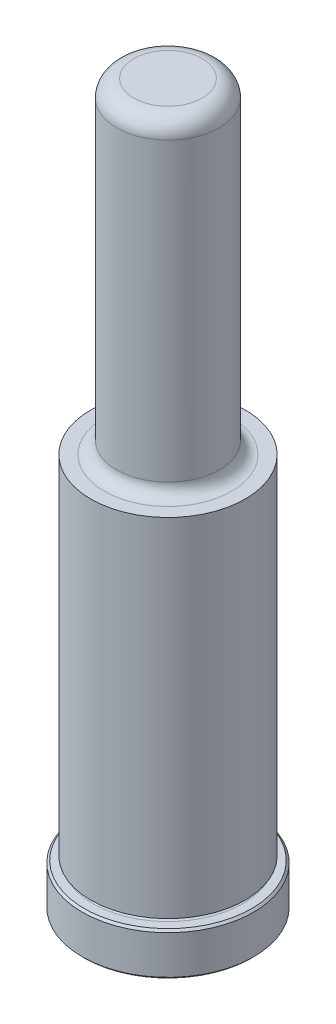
ISO-10303-21;
HEADER;
FILE_DESCRIPTION(('STEP AP214'),'2;1');
FILE_NAME('part.step','',(''),(''),'','','');
FILE_SCHEMA(('AUTOMOTIVE_DESIGN { 1 0 10303 214 1 1 1 1 }'));
ENDSEC;
DATA;
#1=APPLICATION_CONTEXT('core data for automotive mechanical design processes');
#2=APPLICATION_PROTOCOL_DEFINITION('international standard','automotive_design',2000,#1);
#3=PRODUCT_CONTEXT('',#1,'mechanical');
#4=PRODUCT('Part','Part','',(#3));
#5=PRODUCT_RELATED_PRODUCT_CATEGORY('part','',(#4));
#6=PRODUCT_DEFINITION_FORMATION('','',#4);
#7=PRODUCT_DEFINITION_CONTEXT('part definition',#1,'design');
#8=PRODUCT_DEFINITION('design','',#6,#7);
#9=PRODUCT_DEFINITION_SHAPE('','',#8);
#10=(LENGTH_UNIT() NAMED_UNIT(*) SI_UNIT(.MILLI.,.METRE.));
#11=(NAMED_UNIT(*) PLANE_ANGLE_UNIT() SI_UNIT($,.RADIAN.));
#12=(NAMED_UNIT(*) SI_UNIT($,.STERADIAN.) SOLID_ANGLE_UNIT());
#13=UNCERTAINTY_MEASURE_WITH_UNIT(LENGTH_MEASURE(1.E-05),#10,'distance_accuracy_value','');
#14=(GEOMETRIC_REPRESENTATION_CONTEXT(3) GLOBAL_UNCERTAINTY_ASSIGNED_CONTEXT((#13)) GLOBAL_UNIT_ASSIGNED_CONTEXT((#10,
#11,#12)) REPRESENTATION_CONTEXT('',''));
#15=CARTESIAN_POINT('',(0.,0.,0.));
#16=DIRECTION('',(0.,0.,1.));
#17=DIRECTION('',(1.,0.,0.));
#18=AXIS2_PLACEMENT_3D('',#15,#16,#17);
#19=CARTESIAN_POINT('',(0.,0.,0.));
#20=DIRECTION('',(0.,1.,0.));
#21=DIRECTION('',(0.,0.,1.));
#22=AXIS2_PLACEMENT_3D('',#19,#20,#21);
#23=PLANE('',#22);
#24=CARTESIAN_POINT('',(0.,0.,0.));
#25=DIRECTION('',(0.,1.,0.));
#26=DIRECTION('',(0.,0.,1.));
#27=AXIS2_PLACEMENT_3D('',#24,#25,#26);
#28=CIRCLE('',#27,15.494);
#29=CARTESIAN_POINT('',(0.,0.,15.494));
#30=VERTEX_POINT('',#29);
#31=EDGE_CURVE('E46',#30,#30,#28,.F.);
#32=ORIENTED_EDGE('',*,*,#31,.T.);
#33=EDGE_LOOP('',(#32));
#34=FACE_BOUND('',#33,.T.);
#35=ADVANCED_FACE('F31',(#34),#23,.F.);
#36=CARTESIAN_POINT('',(0.,0.,0.));
#37=DIRECTION('',(0.,1.,0.));
#38=DIRECTION('',(0.,0.,1.));
#39=AXIS2_PLACEMENT_3D('',#36,#37,#38);
#40=CYLINDRICAL_SURFACE('',#39,15.875);
#41=CARTESIAN_POINT('',(0.,0.380999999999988,0.));
#42=DIRECTION('',(0.,1.,0.));
#43=DIRECTION('',(0.,0.,1.));
#44=AXIS2_PLACEMENT_3D('',#41,#42,#43);
#45=CIRCLE('',#44,15.875);
#46=CARTESIAN_POINT('',(0.,0.380999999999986,15.875));
#47=VERTEX_POINT('',#46);
#48=EDGE_CURVE('E51',#47,#47,#45,.T.);
#49=ORIENTED_EDGE('',*,*,#48,.T.);
#50=EDGE_LOOP('',(#49));
#51=FACE_BOUND('',#50,.T.);
#52=CARTESIAN_POINT('',(0.,7.54380000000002,0.));
#53=DIRECTION('',(0.,-1.,0.));
#54=DIRECTION('',(0.,0.,-1.));
#55=AXIS2_PLACEMENT_3D('',#52,#53,#54);
#56=CIRCLE('',#55,15.875);
#57=CARTESIAN_POINT('',(0.,7.54380000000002,-15.875));
#58=VERTEX_POINT('',#57);
#59=EDGE_CURVE('E54',#58,#58,#56,.T.);
#60=ORIENTED_EDGE('',*,*,#59,.T.);
#61=EDGE_LOOP('',(#60));
#62=FACE_BOUND('',#61,.T.);
#63=ADVANCED_FACE('F110',(#51,#62),#40,.T.);
#64=CARTESIAN_POINT('',(0.,7.9248,-15.875));
#65=DIRECTION('',(0.,-1.,0.));
#66=DIRECTION('',(0.,0.,-1.));
#67=AXIS2_PLACEMENT_3D('',#64,#65,#66);
#68=PLANE('',#67);
#69=CARTESIAN_POINT('',(0.,7.9248,0.));
#70=DIRECTION('',(0.,-1.,0.));
#71=DIRECTION('',(0.,0.,-1.));
#72=AXIS2_PLACEMENT_3D('',#69,#70,#71);
#73=CIRCLE('',#72,15.494);
#74=CARTESIAN_POINT('',(0.,7.9248,-15.494));
#75=VERTEX_POINT('',#74);
#76=EDGE_CURVE('E42',#75,#75,#73,.F.);
#77=ORIENTED_EDGE('',*,*,#76,.T.);
#78=EDGE_LOOP('',(#77));
#79=FACE_BOUND('',#78,.T.);
#80=CARTESIAN_POINT('',(0.,7.9248,0.));
#81=DIRECTION('',(0.,1.,0.));
#82=DIRECTION('',(0.,0.,1.));
#83=AXIS2_PLACEMENT_3D('',#80,#81,#82);
#84=CIRCLE('',#83,13.8938);
#85=CARTESIAN_POINT('',(0.,7.9248,13.8938));
#86=VERTEX_POINT('',#85);
#87=EDGE_CURVE('E57',#86,#86,#84,.T.);
#88=ORIENTED_EDGE('',*,*,#87,.F.);
#89=EDGE_LOOP('',(#88));
#90=FACE_BOUND('',#89,.T.);
#91=ADVANCED_FACE('F105',(#79,#90),#68,.F.);
#92=CARTESIAN_POINT('',(0.,8.3058,0.));
#93=DIRECTION('',(0.,1.,0.));
#94=DIRECTION('',(0.,0.,1.));
#95=AXIS2_PLACEMENT_3D('',#92,#93,#94);
#96=TOROIDAL_SURFACE('',#95,13.8938,0.381000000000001);
#97=CARTESIAN_POINT('',(0.,8.68680000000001,0.));
#98=DIRECTION('',(0.,1.,0.));
#99=DIRECTION('',(0.,0.,1.));
#100=AXIS2_PLACEMENT_3D('',#97,#98,#99);
#101=CIRCLE('',#100,13.8938);
#102=CARTESIAN_POINT('',(0.,8.6868,13.8938));
#103=VERTEX_POINT('',#102);
#104=EDGE_CURVE('E60',#103,#103,#101,.T.);
#105=ORIENTED_EDGE('',*,*,#104,.F.);
#106=EDGE_LOOP('',(#105));
#107=FACE_BOUND('',#106,.T.);
#108=ORIENTED_EDGE('',*,*,#87,.T.);
#109=EDGE_LOOP('',(#108));
#110=FACE_BOUND('',#109,.T.);
#111=ADVANCED_FACE('F99',(#107,#110),#96,.F.);
#112=CARTESIAN_POINT('',(0.,8.68680000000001,-13.8938));
#113=DIRECTION('',(0.,1.,0.));
#114=DIRECTION('',(0.,0.,1.));
#115=AXIS2_PLACEMENT_3D('',#112,#113,#114);
#116=PLANE('',#115);
#117=CARTESIAN_POINT('',(0.,8.6868,0.));
#118=DIRECTION('',(0.,1.,0.));
#119=DIRECTION('',(0.,0.,1.));
#120=AXIS2_PLACEMENT_3D('',#117,#118,#119);
#121=CIRCLE('',#120,14.3002);
#122=CARTESIAN_POINT('',(0.,8.6868,14.3002));
#123=VERTEX_POINT('',#122);
#124=EDGE_CURVE('E63',#123,#123,#121,.T.);
#125=ORIENTED_EDGE('',*,*,#124,.F.);
#126=EDGE_LOOP('',(#125));
#127=FACE_BOUND('',#126,.T.);
#128=ORIENTED_EDGE('',*,*,#104,.T.);
#129=EDGE_LOOP('',(#128));
#130=FACE_BOUND('',#129,.T.);
#131=ADVANCED_FACE('F93',(#127,#130),#116,.F.);
#132=CARTESIAN_POINT('',(0.,0.,0.));
#133=DIRECTION('',(0.,1.,0.));
#134=DIRECTION('',(0.,0.,1.));
#135=AXIS2_PLACEMENT_3D('',#132,#133,#134);
#136=CYLINDRICAL_SURFACE('',#135,14.3002);
#137=CARTESIAN_POINT('',(0.,73.025,0.));
#138=DIRECTION('',(0.,1.,0.));
#139=DIRECTION('',(0.,0.,1.));
#140=AXIS2_PLACEMENT_3D('',#137,#138,#139);
#141=CIRCLE('',#140,14.3002);
#142=CARTESIAN_POINT('',(0.,73.025,14.3002));
#143=VERTEX_POINT('',#142);
#144=EDGE_CURVE('E66',#143,#143,#141,.T.);
#145=ORIENTED_EDGE('',*,*,#144,.F.);
#146=EDGE_LOOP('',(#145));
#147=FACE_BOUND('',#146,.T.);
#148=ORIENTED_EDGE('',*,*,#124,.T.);
#149=EDGE_LOOP('',(#148));
#150=FACE_BOUND('',#149,.T.);
#151=ADVANCED_FACE('F87',(#147,#150),#136,.T.);
#152=CARTESIAN_POINT('',(0.,73.025,-14.3002));
#153=DIRECTION('',(0.,-1.,0.));
#154=DIRECTION('',(0.,0.,-1.));
#155=AXIS2_PLACEMENT_3D('',#152,#153,#154);
#156=PLANE('',#155);
#157=CARTESIAN_POINT('',(0.,73.025,0.));
#158=DIRECTION('',(0.,1.,0.));
#159=DIRECTION('',(0.,0.,1.));
#160=AXIS2_PLACEMENT_3D('',#157,#158,#159);
#161=CIRCLE('',#160,11.7983);
#162=CARTESIAN_POINT('',(0.,73.025,11.7983));
#163=VERTEX_POINT('',#162);
#164=EDGE_CURVE('E69',#163,#163,#161,.T.);
#165=ORIENTED_EDGE('',*,*,#164,.F.);
#166=EDGE_LOOP('',(#165));
#167=FACE_BOUND('',#166,.T.);
#168=ORIENTED_EDGE('',*,*,#144,.T.);
#169=EDGE_LOOP('',(#168));
#170=FACE_BOUND('',#169,.T.);
#171=ADVANCED_FACE('F81',(#167,#170),#156,.F.);
#172=CARTESIAN_POINT('',(0.,75.311,0.));
#173=DIRECTION('',(0.,1.,0.));
#174=DIRECTION('',(0.,0.,1.));
#175=AXIS2_PLACEMENT_3D('',#172,#173,#174);
#176=TOROIDAL_SURFACE('',#175,11.7983,2.286);
#177=CARTESIAN_POINT('',(0.,75.311,0.));
#178=DIRECTION('',(0.,1.,0.));
#179=DIRECTION('',(0.,0.,1.));
#180=AXIS2_PLACEMENT_3D('',#177,#178,#179);
#181=CIRCLE('',#180,9.5123);
#182=CARTESIAN_POINT('',(0.,75.311,9.51230000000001));
#183=VERTEX_POINT('',#182);
#184=EDGE_CURVE('E72',#183,#183,#181,.T.);
#185=ORIENTED_EDGE('',*,*,#184,.F.);
#186=EDGE_LOOP('',(#185));
#187=FACE_BOUND('',#186,.T.);
#188=ORIENTED_EDGE('',*,*,#164,.T.);
#189=EDGE_LOOP('',(#188));
#190=FACE_BOUND('',#189,.T.);
#191=ADVANCED_FACE('F78',(#187,#190),#176,.F.);
#192=CARTESIAN_POINT('',(0.,0.,0.));
#193=DIRECTION('',(0.,1.,0.));
#194=DIRECTION('',(0.,0.,1.));
#195=AXIS2_PLACEMENT_3D('',#192,#193,#194);
#196=CYLINDRICAL_SURFACE('',#195,9.51230000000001);
#197=CARTESIAN_POINT('',(0.,130.175,0.));
#198=DIRECTION('',(0.,-1.,0.));
#199=DIRECTION('',(0.,0.,-1.));
#200=AXIS2_PLACEMENT_3D('',#197,#198,#199);
#201=CIRCLE('',#200,9.51230000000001);
#202=CARTESIAN_POINT('',(0.,130.175,-9.51229999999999));
#203=VERTEX_POINT('',#202);
#204=EDGE_CURVE('E10',#203,#203,#201,.T.);
#205=ORIENTED_EDGE('',*,*,#204,.T.);
#206=EDGE_LOOP('',(#205));
#207=FACE_BOUND('',#206,.T.);
#208=ORIENTED_EDGE('',*,*,#184,.T.);
#209=EDGE_LOOP('',(#208));
#210=FACE_BOUND('',#209,.T.);
#211=ADVANCED_FACE('F76',(#207,#210),#196,.T.);
#212=CARTESIAN_POINT('',(0.,133.35,-9.51229999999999));
#213=DIRECTION('',(0.,-1.,0.));
#214=DIRECTION('',(0.,0.,-1.));
#215=AXIS2_PLACEMENT_3D('',#212,#213,#214);
#216=PLANE('',#215);
#217=CARTESIAN_POINT('',(0.,133.35,0.));
#218=DIRECTION('',(0.,-1.,0.));
#219=DIRECTION('',(0.,0.,-1.));
#220=AXIS2_PLACEMENT_3D('',#217,#218,#219);
#221=CIRCLE('',#220,6.33730000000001);
#222=CARTESIAN_POINT('',(0.,133.35,-6.33729999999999));
#223=VERTEX_POINT('',#222);
#224=EDGE_CURVE('E38',#223,#223,#221,.F.);
#225=ORIENTED_EDGE('',*,*,#224,.T.);
#226=EDGE_LOOP('',(#225));
#227=FACE_BOUND('',#226,.T.);
#228=ADVANCED_FACE('F127',(#227),#216,.F.);
#229=CARTESIAN_POINT('',(0.,0.380999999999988,0.));
#230=DIRECTION('',(0.,1.,0.));
#231=DIRECTION('',(0.,0.,1.));
#232=AXIS2_PLACEMENT_3D('',#229,#230,#231);
#233=CONICAL_SURFACE('',#232,15.875,0.785398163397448);
#234=ORIENTED_EDGE('',*,*,#31,.F.);
#235=EDGE_LOOP('',(#234));
#236=FACE_BOUND('',#235,.T.);
#237=ORIENTED_EDGE('',*,*,#48,.F.);
#238=EDGE_LOOP('',(#237));
#239=FACE_BOUND('',#238,.T.);
#240=ADVANCED_FACE('F124',(#236,#239),#233,.T.);
#241=CARTESIAN_POINT('',(0.,7.9248,0.));
#242=DIRECTION('',(0.,-1.,0.));
#243=DIRECTION('',(0.,0.,-1.));
#244=AXIS2_PLACEMENT_3D('',#241,#242,#243);
#245=CONICAL_SURFACE('',#244,15.494,0.785398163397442);
#246=ORIENTED_EDGE('',*,*,#59,.F.);
#247=EDGE_LOOP('',(#246));
#248=FACE_BOUND('',#247,.T.);
#249=ORIENTED_EDGE('',*,*,#76,.F.);
#250=EDGE_LOOP('',(#249));
#251=FACE_BOUND('',#250,.T.);
#252=ADVANCED_FACE('F126',(#248,#251),#245,.T.);
#253=CARTESIAN_POINT('',(0.,130.175,0.));
#254=DIRECTION('',(0.,-1.,0.));
#255=DIRECTION('',(0.,0.,-1.));
#256=AXIS2_PLACEMENT_3D('',#253,#254,#255);
#257=TOROIDAL_SURFACE('',#256,6.33730000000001,3.175);
#258=ORIENTED_EDGE('',*,*,#204,.F.);
#259=EDGE_LOOP('',(#258));
#260=FACE_BOUND('',#259,.T.);
#261=ORIENTED_EDGE('',*,*,#224,.F.);
#262=EDGE_LOOP('',(#261));
#263=FACE_BOUND('',#262,.T.);
#264=ADVANCED_FACE('F33',(#260,#263),#257,.T.);
#265=CLOSED_SHELL('',(#35,#63,#91,#111,#131,#151,#171,#191,#211,#228,#240,#252,#264));
#266=MANIFOLD_SOLID_BREP('B2',#265);
#267=ADVANCED_BREP_SHAPE_REPRESENTATION('',(#18,#266),#14);
#268=SHAPE_DEFINITION_REPRESENTATION(#9,#267);
ENDSEC;
END-ISO-10303-21;
